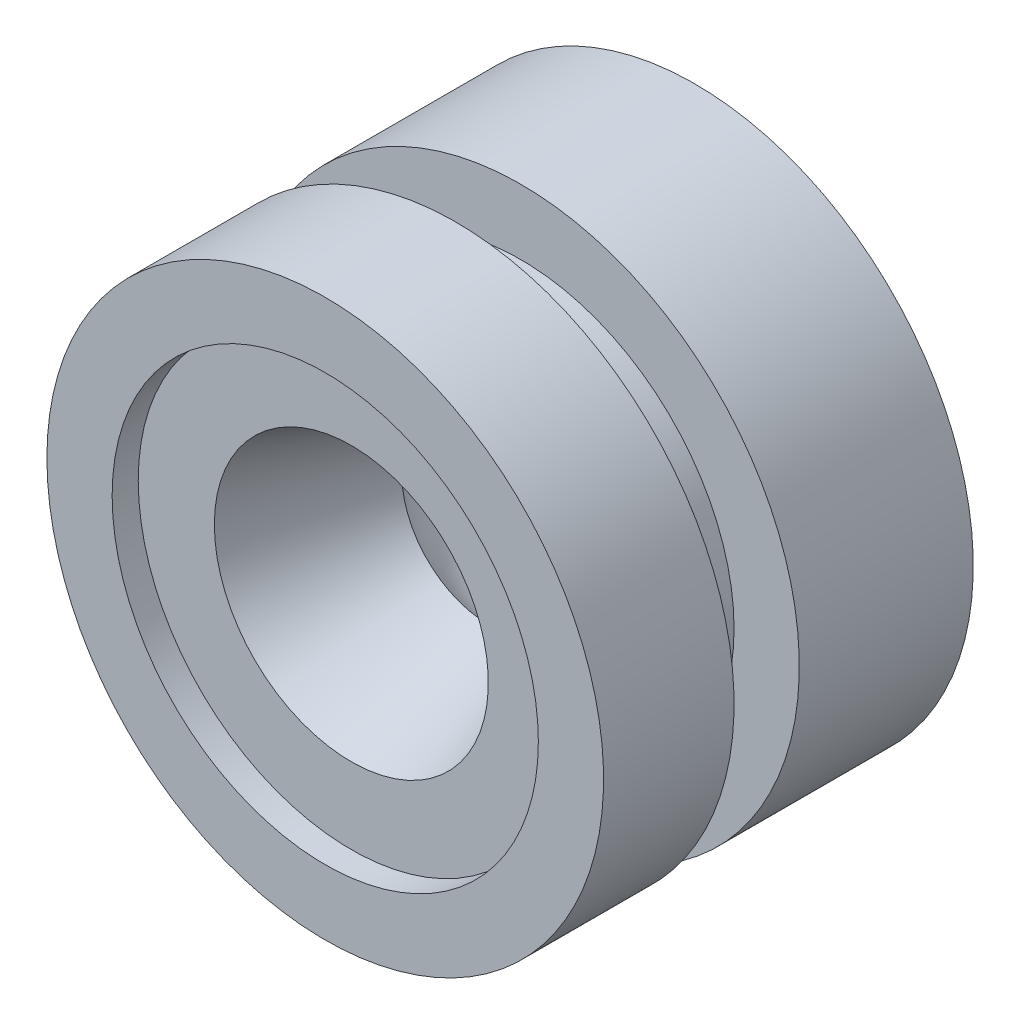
from build123d import *


with BuildPart() as part:
    # Esquisse1 → R_volution1 (revolve)
    with BuildSketch(Plane(origin=(0, 0, 0), x_dir=(1, 0, 0), z_dir=(0, 1, 0))):
        with BuildLine():
            Line((0, 42.840246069), (-3.8, 42.840246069))
            Line((-3.8, 42.840246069), (-3.8, 39.340246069))
            Line((-3.8, 39.340246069), (-5.9, 39.340246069))
            Line((-5.9, 39.340246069), (-5.9, 42.840246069))
            Line((-5.9, 42.840246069), (-6.4, 42.840246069))
            Line((-6.4, 42.840246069), (-6.4, 38.840246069))
            Line((-6.4, 38.840246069), (-4.9, 38.840246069))
            Line((-4.9, 38.840246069), (-4.9, 37.340246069))
            Line((-4.9, 37.340246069), (-6.4, 37.340246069))
            Line((-6.4, 37.340246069), (-6.4, 34.340246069))
            Line((-6.4, 34.340246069), (-4.9, 34.340246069))
            Line((-4.9, 34.340246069), (-4.9, 34.940246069))
            Line((-4.9, 34.940246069), (-3.15, 34.940246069))
            Line((-3.15, 34.940246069), (-2, 38.099845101))
            ThreePointArc((-2, 38.099845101), (-2.236067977, 40.71787909), (0, 42.099845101))
            Line((0, 42.099845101), (0, 42.840246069))
        make_face()
    revolve(axis=Axis((0, 0, -42.840246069), (0, 0, 1)))


solid = part.part
